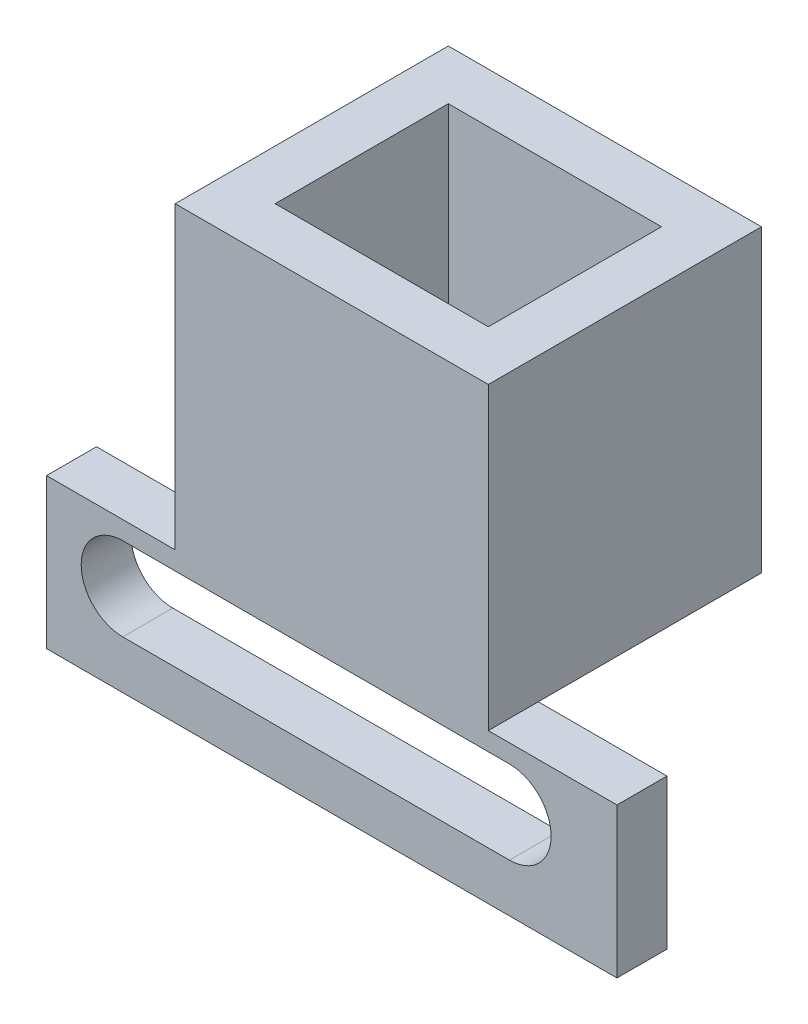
from build123d import *

# Parameters (mm, degrees)
BOSS_EXTRUDE1_DEPTH = 17.85
SKETCH5_R           = 1
CUT_EXTRUDE1_DEPTH  = 10
SKETCH6_W           = 34.25
SKETCH6_H           = 9
BOSS_EXTRUDE2_DEPTH = 3
SKETCH7_W           = 17.85
SKETCH7_H           = 15.1
BOSS_EXTRUDE3_DEPTH = 5.225
BOSS_EXTRUDE4_START = 23.25
SKETCH7_3_W         = 17.85
SKETCH7_3_H         = 15.1
BOSS_EXTRUDE4_DEPTH = 5.225
CUT_EXTRUDE2_REACH  = 125.33
SKETCH8_W           = 7.725
SKETCH8_H           = 18
SKETCH9_W           = 34.25
SKETCH9_H           = 3
BOSS_EXTRUDE5_DEPTH = 18
SKETCH10_W          = 12.8
SKETCH10_H          = 2.9
CUT_EXTRUDE3_DEPTH  = 14.85
CUT_EXTRUDE4_REACH  = 124.932
SKETCH11_W          = 7.725
SKETCH11_H          = 18
SKETCH12_W          = 18.8
SKETCH12_H          = 18
CUT_EXTRUDE5_DEPTH  = 4.45
SKETCH13_W          = 18.8
SKETCH13_H          = 18
BOSS_EXTRUDE6_DEPTH = 3


with BuildPart() as part:
    # Sketch4 → Boss-Extrude1 (new body)
    with BuildSketch(Plane(origin=(0, 0, -70.608208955), x_dir=(-1, 0, 0), z_dir=(0, 0, -1))):
        Polygon((-69.066917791, 81.5), (-45.816917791, 81.5), (-45.816917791, 96.6), (-40.316917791, 96.6), (-40.316917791, 78.6), (-74.566917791, 78.6), (-74.566917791, 96.6), (-69.066917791, 96.6), align=None)
    extrude(amount=BOSS_EXTRUDE1_DEPTH)

    # Sketch5 → Cut-Extrude1 (cut)
    with BuildSketch(Plane(origin=(0, 0, -88.458208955), x_dir=(-1, 0, 0), z_dir=(0, 0, -1))):
        with Locations((-43.741917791, 88)):
            Circle(SKETCH5_R)
        with Locations((-71.141917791, 88)):
            Circle(SKETCH5_R)
    extrude(amount=-CUT_EXTRUDE1_DEPTH, mode=Mode.SUBTRACT)

    # Sketch6 → Boss-Extrude2 (add)
    with BuildSketch(Plane(origin=(0, 0, -70.608208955), x_dir=(-1, 0, 0), z_dir=(0, 0, -1))):
        with Locations((-57.441917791, 74.1)):
            Rectangle(SKETCH6_W, SKETCH6_H)
        with BuildLine():
            Line((-68.111940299, 77.5), (-44.896828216, 77.5))
            ThreePointArc((-44.896828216, 77.5), (-42.396828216, 75), (-44.896828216, 72.5))
            Line((-44.896828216, 72.5), (-68.111940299, 72.5))
            ThreePointArc((-68.111940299, 72.5), (-70.611940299, 75), (-68.111940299, 77.5))
        make_face(mode=Mode.SUBTRACT)
    extrude(amount=BOSS_EXTRUDE2_DEPTH)

    # Sketch7 → Boss-Extrude3 (add)
    with BuildSketch(Plane(origin=(45.816917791, 0, 0), x_dir=(0, 0, -1), z_dir=(1, 0, 0))):
        with Locations((79.533208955, 89.05)):
            Rectangle(SKETCH7_W, SKETCH7_H)
    extrude(amount=BOSS_EXTRUDE3_DEPTH)

    # Sketch7_3 → Boss-Extrude4 (add)
    with BuildSketch(Plane(origin=(45.816917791, 0, 0), x_dir=(0, 0, -1), z_dir=(1, 0, 0)).offset(BOSS_EXTRUDE4_START)):
        with Locations((79.533208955, 89.05)):
            Rectangle(SKETCH7_3_W, SKETCH7_3_H)
    extrude(amount=-BOSS_EXTRUDE4_DEPTH)

    # Sketch8 → Cut-Extrude2 (cut, up to next)
    with BuildSketch(Plane(origin=(0, 0, -88.458208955), x_dir=(-1, 0, 0), z_dir=(0, 0, -1)), mode=Mode.PRIVATE) as cut_extrude2_sk1:
        with Locations((-70.704417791, 87.6)):
            Rectangle(SKETCH8_W, SKETCH8_H)
    cut_extrude2_tool1 = extrude(cut_extrude2_sk1.sketch, amount=-CUT_EXTRUDE2_REACH, mode=Mode.PRIVATE) & part.part
    # Sketch8 → Cut-Extrude2 (cut, up to next)
    with BuildSketch(Plane(origin=(0, 0, -88.458208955), x_dir=(-1, 0, 0), z_dir=(0, 0, -1)), mode=Mode.PRIVATE) as cut_extrude2_sk2:
        with Locations((-44.179417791, 87.6)):
            Rectangle(SKETCH8_W, SKETCH8_H)
    cut_extrude2_tool2 = extrude(cut_extrude2_sk2.sketch, amount=-CUT_EXTRUDE2_REACH, mode=Mode.PRIVATE) & part.part
    add(cut_extrude2_tool1.solids().sort_by_distance((70.704418, 87.6, -88.458209))[0], mode=Mode.SUBTRACT)
    add(cut_extrude2_tool2.solids().sort_by_distance((44.179418, 87.6, -88.458209))[0], mode=Mode.SUBTRACT)

    # Sketch9 → Boss-Extrude5 (add)
    with BuildSketch(Plane(origin=(0, 78.6, 0), x_dir=(1, 0, 0), z_dir=(0, 1, 0))):
        with Locations((57.441917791, 72.108208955)):
            Rectangle(SKETCH9_W, SKETCH9_H)
    extrude(amount=BOSS_EXTRUDE5_DEPTH)

    # Sketch10 → Cut-Extrude3 (cut)
    with BuildSketch(Plane(origin=(0, 0, -88.458208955), x_dir=(-1, 0, 0), z_dir=(0, 0, -1))):
        with Locations((-57.441917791, 80.05)):
            Rectangle(SKETCH10_W, SKETCH10_H)
    extrude(amount=-CUT_EXTRUDE3_DEPTH, mode=Mode.SUBTRACT)

    # Sketch11 → Cut-Extrude4 (cut, up to next)
    with BuildSketch(Plane(origin=(0, 0, -73.608208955), x_dir=(-1, 0, 0), z_dir=(0, 0, -1)), mode=Mode.PRIVATE) as cut_extrude4_sk1:
        with Locations((-70.704417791, 87.6)):
            Rectangle(SKETCH11_W, SKETCH11_H)
    cut_extrude4_tool1 = extrude(cut_extrude4_sk1.sketch, amount=-CUT_EXTRUDE4_REACH, mode=Mode.PRIVATE) & part.part
    # Sketch11 → Cut-Extrude4 (cut, up to next)
    with BuildSketch(Plane(origin=(0, 0, -73.608208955), x_dir=(-1, 0, 0), z_dir=(0, 0, -1)), mode=Mode.PRIVATE) as cut_extrude4_sk2:
        with Locations((-44.179417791, 87.6)):
            Rectangle(SKETCH11_W, SKETCH11_H)
    cut_extrude4_tool2 = extrude(cut_extrude4_sk2.sketch, amount=-CUT_EXTRUDE4_REACH, mode=Mode.PRIVATE) & part.part
    add(cut_extrude4_tool1.solids().sort_by_distance((70.704418, 87.6, -73.608209))[0], mode=Mode.SUBTRACT)
    add(cut_extrude4_tool2.solids().sort_by_distance((44.179418, 87.6, -73.608209))[0], mode=Mode.SUBTRACT)

    # Sketch12 → Cut-Extrude5 (cut)
    with BuildSketch(Plane(origin=(0, 0, -88.458208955), x_dir=(-1, 0, 0), z_dir=(0, 0, -1))):
        with Locations((-57.441917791, 87.6)):
            Rectangle(SKETCH12_W, SKETCH12_H)
    extrude(amount=-CUT_EXTRUDE5_DEPTH, mode=Mode.SUBTRACT)

    # Sketch13 → Boss-Extrude6 (add)
    with BuildSketch(Plane(origin=(0, 0, -84.008208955), x_dir=(-1, 0, 0), z_dir=(0, 0, -1))):
        with Locations((-57.441917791, 87.6)):
            Rectangle(SKETCH13_W, SKETCH13_H)
    extrude(amount=BOSS_EXTRUDE6_DEPTH)


solid = part.part
